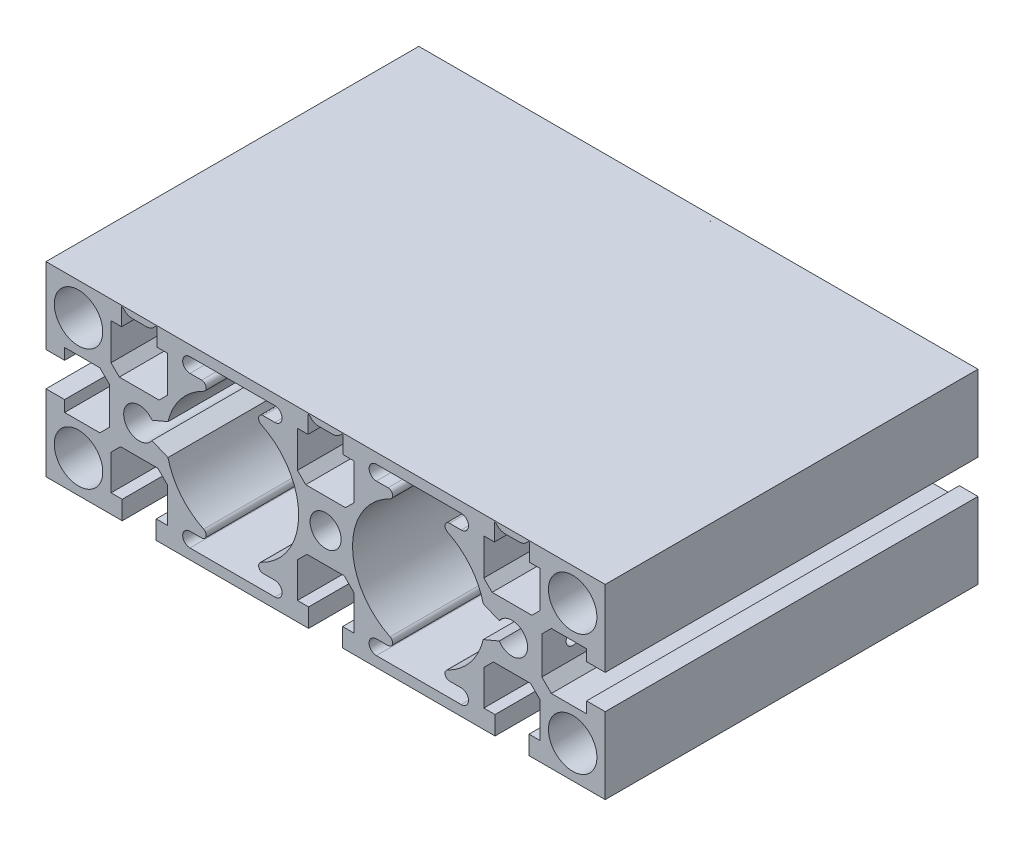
from build123d import *

# Parameters (mm, degrees)
SKETCH1_R                  = 5.85
SKETCH1_R_2                = 3.75
EXTRUDE1_DEPTH             = 90
M4_TAPPED_HOLE1_AT_2_COUNT = 2
M4_TAPPED_HOLE1_AT_2_PITCH = 75


with BuildPart() as part:
    # Sketch1 → Extrude1 (new body)
    with BuildSketch(Plane.XY):
        Polygon((62.999999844, 4.100002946), (67.500000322, 4.100002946), (67.499999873, 22.500001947), (-67.500000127, 22.499998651), (-67.499999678, 4.099998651), (-62.999999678, 4.099998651), (-62.999999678, 6.799998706), (-54.499999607, 6.79999881), (-52.199999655, 4.49999897), (-52.199999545, -4.50000114), (-54.499999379, -6.800001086), (-62.999999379, -6.80000119), (-62.999999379, -4.100001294), (-67.499999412, -4.100001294), (-67.499999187, -22.500001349), (-49.099998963, -22.500001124), (-49.099998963, -18.000000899), (-51.799999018, -18.000000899), (-51.799999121, -9.500000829), (-49.499999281, -7.200000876), (-40.499999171, -7.200000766), (-38.199999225, -9.5000006), (-38.199999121, -18.0000006), (-40.899999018, -18.0000006), (-40.899999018, -22.500000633), (-4.099998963, -22.500000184), (-4.099998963, -17.999999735), (-6.799999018, -17.999999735), (-6.799999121, -9.499999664), (-4.499999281, -7.199999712), (4.500000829, -7.199999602), (6.800000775, -9.499999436), (6.800000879, -17.999999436), (4.100000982, -17.999999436), (4.100000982, -22.499999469), (40.900001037, -22.49999902), (40.900001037, -17.999998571), (38.200000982, -17.999998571), (38.200000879, -9.4999985), (40.500000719, -7.199998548), (49.500000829, -7.199998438), (51.800000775, -9.499998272), (51.800000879, -17.99999764), (49.100000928, -17.99999764), (49.100000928, -22.499997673), (67.500000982, -22.499997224), (67.500000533, -4.099996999), (63.000000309, -4.099996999), (63.000000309, -6.799997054), (54.500000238, -6.799997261), (52.200000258, -4.499997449), (52.200000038, 4.50000266), (54.499999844, 6.800002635), (62.999999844, 6.800002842), align=None)
        with Locations(Location((59.65, 14.65, 0), (0, 0, 180))):
            Circle(SKETCH1_R, mode=Mode.SUBTRACT)
        with Locations(Location((59.65, -14.65, 0), (0, 0, 180))):
            Circle(SKETCH1_R, mode=Mode.SUBTRACT)
        with Locations(Location((-59.65, -14.65, 0), (0, 0, 180))):
            Circle(SKETCH1_R, mode=Mode.SUBTRACT)
        with Locations(Location((-59.65, 14.65, 0), (0, 0, 180))):
            Circle(SKETCH1_R, mode=Mode.SUBTRACT)
        with Locations(Location((0, 0, 0), (0, 0, 180))):
            Circle(SKETCH1_R_2, mode=Mode.SUBTRACT)
        with BuildLine():
            Line((-38.054339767, -3.75), (-41.910198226, -2.125))
            ThreePointArc((-41.910198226, -2.125), (-48.75, 0), (-41.910198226, 2.125))
            Line((-41.910198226, 2.125), (-38.054339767, 3.75))
            ThreePointArc((-38.054339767, 3.75), (-34.949722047, 10.050094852), (-29.446108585, 14.413589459))
            ThreePointArc((-29.446108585, 14.413589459), (-28.852553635, 15.646770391), (-29.922620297, 16.499999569))
            Line((-29.922620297, 16.499999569), (-32.749999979, 16.499999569))
            ThreePointArc((-32.749999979, 16.499999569), (-34.499999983, 18.24999953), (-32.750000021, 19.999999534))
            Line((-32.750000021, 19.999999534), (-12.250000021, 19.999999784))
            ThreePointArc((-12.250000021, 19.999999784), (-10.500000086, 18.249999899), (-12.249999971, 16.499999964))
            Line((-12.249999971, 16.499999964), (-15.077380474, 16.499999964))
            ThreePointArc((-15.077380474, 16.499999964), (-16.147447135, 15.646770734), (-15.553892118, 14.413589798))
            ThreePointArc((-15.553892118, 14.413589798), (-6.500000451, 0), (-15.553892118, -14.413589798))
            ThreePointArc((-15.553892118, -14.413589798), (-16.147447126, -15.646770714), (-15.077380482, -16.499999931))
            Line((-15.077380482, -16.499999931), (-12.249999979, -16.499999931))
            ThreePointArc((-12.249999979, -16.499999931), (-10.499999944, -18.250000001), (-12.250000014, -20.000000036))
            Line((-12.250000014, -20.000000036), (-32.750000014, -19.999999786))
            ThreePointArc((-32.750000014, -19.999999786), (-34.500000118, -18.24999964), (-32.749999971, -16.499999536))
            Line((-32.749999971, -16.499999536), (-29.92262029, -16.499999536))
            ThreePointArc((-29.92262029, -16.499999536), (-28.852553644, -15.646770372), (-29.446108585, -14.413589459))
            ThreePointArc((-29.446108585, -14.413589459), (-34.949722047, -10.050094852), (-38.054339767, -3.75))
        make_face(mode=Mode.SUBTRACT)
        with BuildLine():
            Line((12.249999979, -16.5), (15.077380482, -16.5))
            ThreePointArc((15.077380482, -16.5), (16.147447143, -15.64677077), (15.553892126, -14.413589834))
            ThreePointArc((15.553892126, -14.413589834), (6.500000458, -3.6e-08), (15.553892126, 14.413589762))
            ThreePointArc((15.553892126, 14.413589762), (16.147447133, 15.646770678), (15.077380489, 16.499999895))
            Line((15.077380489, 16.499999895), (12.249999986, 16.499999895))
            ThreePointArc((12.249999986, 16.499999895), (10.49999999, 18.249999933), (12.250000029, 19.999999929))
            Line((12.250000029, 19.999999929), (32.750000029, 19.999999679))
            ThreePointArc((32.750000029, 19.999999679), (34.500000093, 18.249999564), (32.749999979, 16.4999995))
            Line((32.749999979, 16.4999995), (29.922620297, 16.4999995))
            ThreePointArc((29.922620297, 16.4999995), (28.852553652, 15.646770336), (29.446108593, 14.413589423))
            ThreePointArc((29.446108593, 14.413589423), (34.949722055, 10.050094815), (38.054339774, 3.749999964))
            Line((38.054339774, 3.749999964), (41.910198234, 2.124999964))
            ThreePointArc((41.910198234, 2.124999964), (48.750000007, -3.6e-08), (41.910198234, -2.125000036))
            Line((41.910198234, -2.125000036), (38.054339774, -3.750000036))
            ThreePointArc((38.054339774, -3.750000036), (34.949722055, -10.050094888), (29.446108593, -14.413589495))
            ThreePointArc((29.446108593, -14.413589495), (28.852553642, -15.646770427), (29.922620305, -16.499999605))
            Line((29.922620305, -16.499999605), (32.749999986, -16.499999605))
            ThreePointArc((32.749999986, -16.499999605), (34.499999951, -18.249999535), (32.750000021, -19.9999995))
            Line((32.750000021, -19.9999995), (12.250000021, -19.99999975))
            ThreePointArc((12.250000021, -19.99999975), (10.500000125, -18.249999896), (12.249999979, -16.5))
        make_face(mode=Mode.SUBTRACT)
        with BuildLine():
            Line((41.05001828, 22.200012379), (41.517795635, 21.732234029))
            ThreePointArc((41.517795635, 21.732234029), (42.328854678, 21.190300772), (43.285564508, 20.999999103))
            Line((43.285564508, 20.999999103), (46.714465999, 20.999999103))
            ThreePointArc((46.714465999, 20.999999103), (47.671213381, 21.190316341), (48.482292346, 21.732291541))
            Line((48.482292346, 21.732291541), (48.949981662, 22.200012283))
            Line((48.949981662, 22.200012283), (49.249999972, 22.200012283))
            Line((49.249999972, 22.200012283), (49.249999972, 17.999999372))
            Line((49.249999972, 17.999999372), (51.800018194, 17.999999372))
            Line((51.800018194, 17.999999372), (51.800018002, 9.200011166))
            Line((51.800018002, 9.200011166), (49.800017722, 7.200011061))
            Line((49.800017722, 7.200011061), (40.200011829, 7.200011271))
            Line((40.200011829, 7.200011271), (38.200011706, 9.200011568))
            Line((38.200011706, 9.200011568), (38.200011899, 17.999999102))
            Line((38.200011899, 17.999999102), (40.749999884, 17.999999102))
            Line((40.749999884, 17.999999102), (40.749999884, 22.200012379))
            Line((40.749999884, 22.200012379), (41.05001828, 22.200012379))
        make_face(mode=Mode.SUBTRACT)
        with BuildLine():
            Line((-3.94998172, 22.200012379), (-3.482204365, 21.732234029))
            ThreePointArc((-3.482204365, 21.732234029), (-2.671145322, 21.190300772), (-1.714435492, 20.999999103))
            Line((-1.714435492, 20.999999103), (1.714465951, 20.999999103))
            ThreePointArc((1.714465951, 20.999999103), (2.671213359, 21.190316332), (3.482292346, 21.732291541))
            Line((3.482292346, 21.732291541), (3.949981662, 22.200012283))
            Line((3.949981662, 22.200012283), (4.249999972, 22.200012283))
            Line((4.249999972, 22.200012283), (4.249999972, 17.999999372))
            Line((4.249999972, 17.999999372), (6.800018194, 17.999999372))
            Line((6.800018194, 17.999999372), (6.800018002, 9.200011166))
            Line((6.800018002, 9.200011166), (4.800017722, 7.200011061))
            Line((4.800017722, 7.200011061), (-4.799988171, 7.200011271))
            Line((-4.799988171, 7.200011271), (-6.799988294, 9.200011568))
            Line((-6.799988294, 9.200011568), (-6.799988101, 17.999999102))
            Line((-6.799988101, 17.999999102), (-4.250000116, 17.999999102))
            Line((-4.250000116, 17.999999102), (-4.250000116, 22.200012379))
            Line((-4.250000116, 22.200012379), (-3.94998172, 22.200012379))
        make_face(mode=Mode.SUBTRACT)
        with BuildLine():
            Line((-49.799988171, 7.200011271), (-51.799988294, 9.200011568))
            Line((-51.799988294, 9.200011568), (-51.799988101, 17.999999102))
            Line((-51.799988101, 17.999999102), (-49.250000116, 17.999999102))
            Line((-49.250000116, 17.999999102), (-49.250000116, 22.200012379))
            Line((-49.250000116, 22.200012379), (-48.94998172, 22.200012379))
            Line((-48.94998172, 22.200012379), (-48.482204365, 21.732234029))
            ThreePointArc((-48.482204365, 21.732234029), (-47.671145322, 21.190300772), (-46.714435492, 20.999999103))
            Line((-46.714435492, 20.999999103), (-43.285534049, 20.999999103))
            ThreePointArc((-43.285534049, 20.999999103), (-42.328786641, 21.190316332), (-41.517707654, 21.732291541))
            Line((-41.517707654, 21.732291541), (-41.050018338, 22.200012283))
            Line((-41.050018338, 22.200012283), (-40.750000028, 22.200012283))
            Line((-40.750000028, 22.200012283), (-40.750000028, 17.999999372))
            Line((-40.750000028, 17.999999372), (-38.199981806, 17.999999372))
            Line((-38.199981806, 17.999999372), (-38.199981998, 9.200011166))
            Line((-38.199981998, 9.200011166), (-40.199982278, 7.200011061))
            Line((-40.199982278, 7.200011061), (-49.799988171, 7.200011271))
        make_face(mode=Mode.SUBTRACT)
    extrude(amount=EXTRUDE1_DEPTH)

    # Sketch3 → M4 Tapped Hole1 (revolve, cut)
    with BuildSketch(Plane(origin=(67.500000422, 1.947e-06, 82.5), x_dir=(-2.440825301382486e-08, 0.9999999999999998, 0), z_dir=(0, 0, 1))):
        Polygon((0, 0), (0, 45.441420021), (1.65, 44.45), (1.65, 0), align=None)
    m4_tapped_hole1 = revolve(axis=Axis((73.850000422, 2.102e-06, 82.5), (-0.9999999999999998, -2.4408253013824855e-08, 0)), mode=Mode.SUBTRACT)

    # M4 Tapped Hole1 at 2: M4 Tapped Hole1 ×2
    with Locations(*[(0, 0, -i * M4_TAPPED_HOLE1_AT_2_PITCH) for i in range(1, M4_TAPPED_HOLE1_AT_2_COUNT)]):
        add(m4_tapped_hole1, mode=Mode.SUBTRACT)

    # Mirror1: M4 Tapped Hole1 across plane
    add(m4_tapped_hole1.mirror(Plane(origin=(0, 0, 0), x_dir=(0, 0, 1), z_dir=(1, 0, 0))), mode=Mode.SUBTRACT)

    # Mirror1 copy 1 sketch → Mirror1 copy 1 (revolve, cut)
    with BuildSketch(Plane(origin=(-67.500000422, 1.947e-06, 7.5), x_dir=(2.440825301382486e-08, 0.9999999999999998, 0), z_dir=(0, 0, 1))):
        Polygon((0, 0), (0, -45.441420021), (1.65, -44.45), (1.65, 0), align=None)
    revolve(axis=Axis((-73.850000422, 2.102e-06, 7.5), (-0.9999999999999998, 2.4408253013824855e-08, 0)), mode=Mode.SUBTRACT)


solid = part.part
